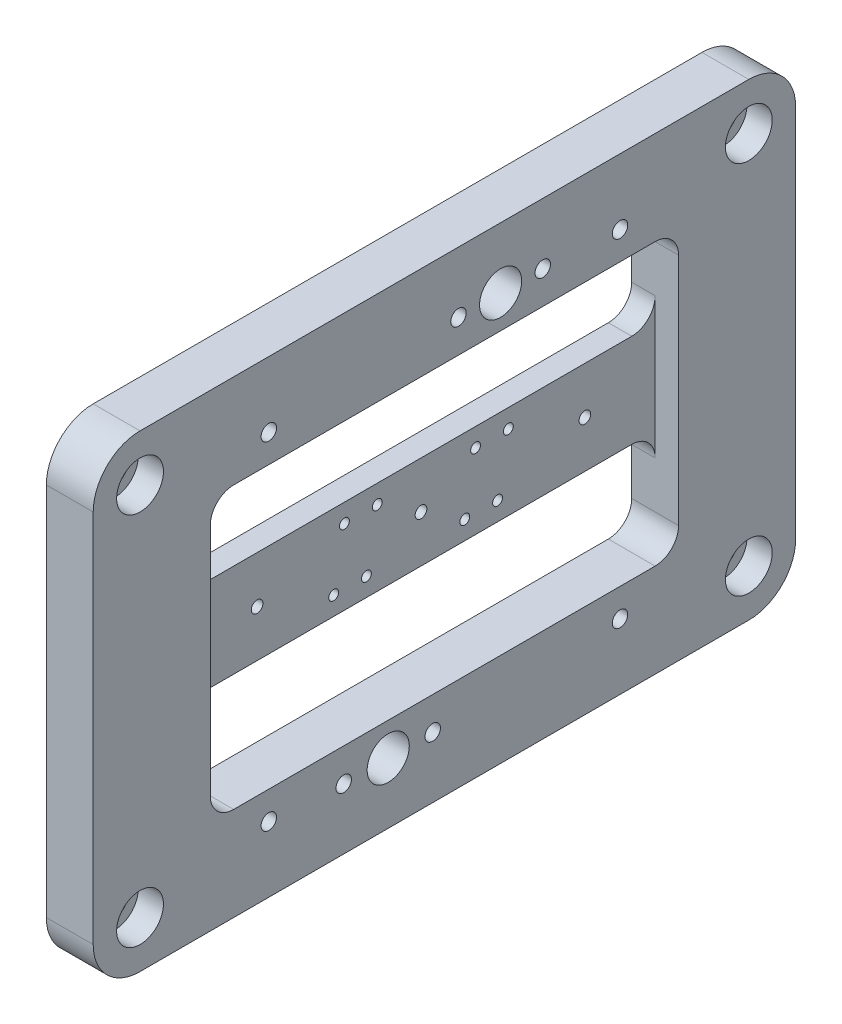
from build123d import *

# Parameters (mm, degrees)
EXTRUDE_1_DEPTH              = 10
F_12_0MM_1_D                 = 12.2
F_12_0MM_1_DEPTH             = 2.9
HOLE_WIZARD_9_0_9_1_D        = 9
HOLE_WIZARD_9_0_9_1_DEPTH    = 15
HOLE_WIZARD_9_0_9_1_TIP      = 2.703872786
SKETCH_13_R                  = 4
CUT_EXTRUDE_2_DEPTH          = 2.6
HOLE_WIZARD_M5_1_D           = 5.5
HOLE_WIZARD_M5_1_CBORE_D     = 10
HOLE_WIZARD_M5_1_CBORE_DEPTH = 5.4
HOLE_WIZARD_M4_1_D           = 3.3
SKETCH_18_W                  = 100
SKETCH_18_H                  = 60
CUT_EXTRUDE_3_DEPTH          = 91.691785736
FILLET_1_R                   = 5
HOLE_WIZARD_M4_2_D           = 3.3
FILLET_3_R                   = 0.5
SKETCH_30_W                  = 100
SKETCH_30_H                  = 20
EXTRUDE_2_DEPTH              = 10
FILLET_4_R                   = 5
HOLE_WIZARD_2_1_2_1_1_D      = 2.1
SKETCH_33_W                  = 100
SKETCH_33_H                  = 30
CUT_EXTRUDE_4_DEPTH          = 5
SKETCH_34_R                  = 1.599999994
SKETCH_34_R_2                = 1.600000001
CUT_EXTRUDE_5_DEPTH          = 2
HOLE_WIZARD_M3_4_D           = 2.5
PATTERN_LINEAR_1_COUNT       = 2
PATTERN_LINEAR_1_PITCH       = 28


with BuildPart() as part:
    # Sketch 1 → Extrude 1 (new body)
    with BuildSketch(Plane(origin=(0, 0, 0), x_dir=(0, 0, -1), z_dir=(1, 0, 0))):
        with BuildLine():
            Line((-65, 50), (65, 50))
            ThreePointArc((65, 50), (72.071067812, 47.071067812), (75, 40))
            Line((75, 40), (75, -40))
            ThreePointArc((75, -40), (72.071067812, -47.071067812), (65, -50))
            Line((65, -50), (-65, -50))
            ThreePointArc((-65, -50), (-72.071067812, -47.071067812), (-75, -40))
            Line((-75, -40), (-75, 40))
            ThreePointArc((-75, 40), (-72.071067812, 47.071067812), (-65, 50))
        make_face()
    extrude(amount=EXTRUDE_1_DEPTH)

    # 12.0mm _1
    with Locations(Plane.ZY):
        with Locations((-12, 37), (12, -37)):
            Hole(F_12_0MM_1_D / 2, depth=F_12_0MM_1_DEPTH)

    # Hole Wizard 9.0 _9_ _1
    with Locations(Plane(origin=(10, 0, 0), x_dir=(0, 0, -1), z_dir=(1, 0, 0))):
        with Locations((-12, -37), (12, 37)):
            Hole(HOLE_WIZARD_9_0_9_1_D / 2, depth=HOLE_WIZARD_9_0_9_1_DEPTH)
            with Locations((0, 0, -(HOLE_WIZARD_9_0_9_1_DEPTH + HOLE_WIZARD_9_0_9_1_TIP / 2))):  # 118° drill point
                Cone(0, HOLE_WIZARD_9_0_9_1_D / 2, HOLE_WIZARD_9_0_9_1_TIP, mode=Mode.SUBTRACT)

    # Sketch 13 → Cut-Extrude 2 (cut)
    with BuildSketch(Plane.ZY):
        with Locations((65, 40)):
            Circle(SKETCH_13_R)
        with Locations(Location((65, -40, 0), (0, 0, 180))):
            Circle(SKETCH_13_R)
        with Locations((-65, -40)):
            Circle(SKETCH_13_R)
        with Locations(Location((-65, 40, 0), (0, 0, 180))):
            Circle(SKETCH_13_R)
    extrude(amount=-CUT_EXTRUDE_2_DEPTH, mode=Mode.SUBTRACT)

    # Hole Wizard M5 _1 (through all)
    with Locations(Plane(origin=(10, 0, 0), x_dir=(0, 0, -1), z_dir=(1, 0, 0))):
        with Locations((-65, 40), (65, 40), (65, -40), (-65, -40)):
            CounterBoreHole(HOLE_WIZARD_M5_1_D / 2, HOLE_WIZARD_M5_1_CBORE_D / 2, HOLE_WIZARD_M5_1_CBORE_DEPTH)

    # Hole Wizard M4 _1 (through all)
    with Locations(Plane.ZY):
        with Locations((-21, 37), (-3, 37), (21.5, -37), (2.5, -37)):
            Hole(HOLE_WIZARD_M4_1_D / 2)

    # Sketch 18 → Cut-Extrude 3 (cut, through all)
    with BuildSketch(Plane.ZY):
        Rectangle(SKETCH_18_W, SKETCH_18_H)
    extrude(amount=-CUT_EXTRUDE_3_DEPTH, mode=Mode.SUBTRACT)

    # Fillet 1
    fillet_1_edges = [part.edges().sort_by_distance(p)[0] for p in [
        (5, 30, 50),
        (5, -30, 50),
        (5, -30, -50),
        (5, 30, -50),
    ]]
    fillet(fillet_1_edges, radius=FILLET_1_R)

    # Hole Wizard M4 _2 (through all)
    with Locations(Plane.ZY):
        with Locations((37.5, -36), (37.5, 36), (-37.5, 36), (-37.5, -36)):
            Hole(HOLE_WIZARD_M4_2_D / 2)

    # Fillet 3
    fillet_3_edges = [part.edges().sort_by_distance(p)[0] for p in [
        (2.9, 37, -16.5),
        (2.9, -37, 7.5),
    ]]
    fillet(fillet_3_edges, radius=FILLET_3_R)

    # Sketch 30 → Extrude 2 (add)
    with BuildSketch(Plane(origin=(10, 0, 0), x_dir=(0, 0, -1), z_dir=(1, 0, 0))):
        Rectangle(SKETCH_30_W, SKETCH_30_H)
    extrude(amount=-EXTRUDE_2_DEPTH)

    # Fillet 4
    fillet_4_edges = [part.edges().sort_by_distance(p)[0] for p in [
        (5, 10, 50),
        (5, -10, 50),
        (5, -10, -50),
        (5, 10, -50),
    ]]
    fillet(fillet_4_edges, radius=FILLET_4_R)

    # Hole Wizard 2.1 _2.1_ _1 (through all)
    with Locations(Plane(origin=(10, 0, 0), x_dir=(0, 0, -1), z_dir=(1, 0, 0))):
        with Locations((-9.34500582, 6.029886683), (-11.65499418, -6.029886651), (-16.34500582, 6.02988667), (-18.65499418, -6.029886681)):
            hole_wizard_2_1_2_1_1 = Hole(HOLE_WIZARD_2_1_2_1_1_D / 2)

    # Sketch 33 → Cut-Extrude 4 (cut)
    with BuildSketch(Plane(origin=(10, 0, 0), x_dir=(0, 0, -1), z_dir=(1, 0, 0))):
        Rectangle(SKETCH_33_W, SKETCH_33_H)
    extrude(amount=-CUT_EXTRUDE_4_DEPTH, mode=Mode.SUBTRACT)

    # Sketch 34 → Cut-Extrude 5 (cut)
    with BuildSketch(Plane.ZY):
        with Locations((9.34500582, 6.029886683)):
            Circle(SKETCH_34_R)
        with Locations((16.34500582, 6.02988667)):
            Circle(SKETCH_34_R_2)
        with Locations((11.65499418, -6.029886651)):
            Circle(SKETCH_34_R)
        with Locations((18.65499418, -6.029886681)):
            Circle(SKETCH_34_R_2)
    cut_extrude_5 = extrude(amount=-CUT_EXTRUDE_5_DEPTH, mode=Mode.SUBTRACT)

    # Hole Wizard M3 _4 (through all)
    with Locations(Plane.ZY):
        with Locations((-35, 0), (0, 0), (35, 0)):
            Hole(HOLE_WIZARD_M3_4_D / 2)

    # Pattern Linear 1: Hole Wizard 2.1 _2.1_ _1, Cut-Extrude 5 ×2
    with Locations(*[(0, 0, -i * PATTERN_LINEAR_1_PITCH) for i in range(1, PATTERN_LINEAR_1_COUNT)]):
        add(hole_wizard_2_1_2_1_1, mode=Mode.SUBTRACT)
        add(cut_extrude_5, mode=Mode.SUBTRACT)


solid = part.part
